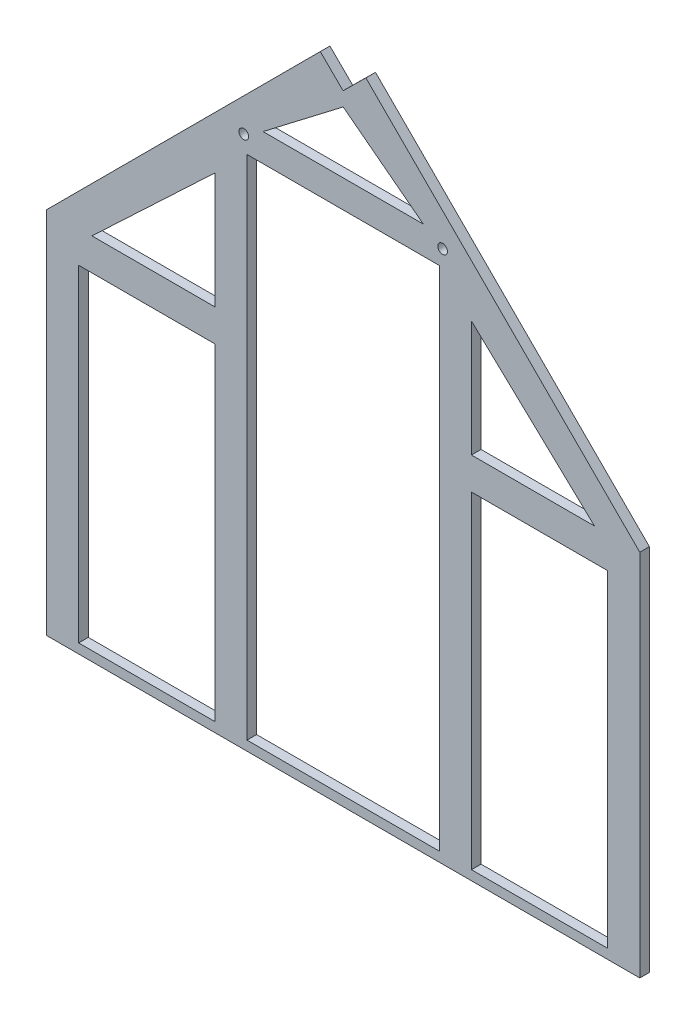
from build123d import *

# Parameters (mm, degrees)
ESQUISSE1_R      = 1.5
ESQUISSE1_W      = 42.5
ESQUISSE1_H      = 102
ESQUISSE1_W_2    = 60
ESQUISSE1_H_2    = 158.178932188
EXTRUSION2_DEPTH = 3


with BuildPart() as part:
    # Esquisse1 → Extrusion2 (new body)
    with BuildSketch(Plane.XY):
        Polygon((0, 0), (0, 115), (85.360989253, 200.394953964), (92.465945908, 193.357938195), (99.571067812, 200.394953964), (185, 115), (185, 0), align=None)
        with Locations((61.5, 166.178932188)):
            Circle(ESQUISSE1_R, mode=Mode.SUBTRACT)
        with Locations(Location((123.5, 166.178932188, 0), (0, 0, 180))):
            Circle(ESQUISSE1_R, mode=Mode.SUBTRACT)
        Polygon((132.5, 151.178932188), (132.5, 115), (170.857864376, 115), align=None, mode=Mode.SUBTRACT)
        Polygon((52.5, 151.178932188), (14.142135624, 115), (52.5, 115), align=None, mode=Mode.SUBTRACT)
        with Locations((31.25, 54)):
            Rectangle(ESQUISSE1_W, ESQUISSE1_H, mode=Mode.SUBTRACT)
        with Locations((92.5, 82.089466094)):
            Rectangle(ESQUISSE1_W_2, ESQUISSE1_H_2, mode=Mode.SUBTRACT)
        with Locations((153.75, 54)):
            Rectangle(ESQUISSE1_W, ESQUISSE1_H, mode=Mode.SUBTRACT)
        Polygon((92.5, 189), (67.5, 169.857864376), (117.5, 169.857864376), align=None, mode=Mode.SUBTRACT)
    extrude(amount=EXTRUSION2_DEPTH)


solid = part.part
